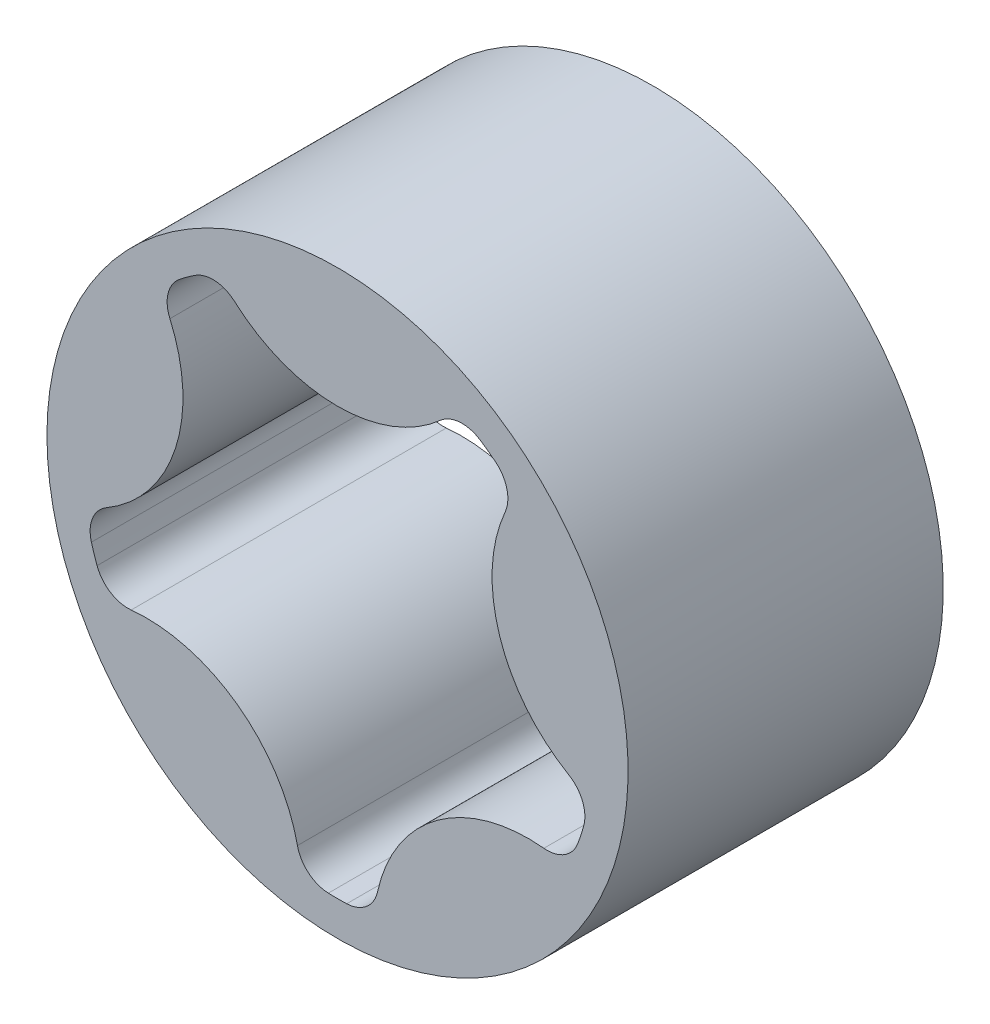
from build123d import *

# Parameters (mm, degrees)
SKETCH1_R          = 20.2565
BASE_EXTRUDE_DEPTH = 21.971


with BuildPart() as part:
    # Sketch1 → Base-Extrude (new body)
    with BuildSketch(Plane.XY):
        with Locations(Location((0, 0, 0), (0, 0, 180))):
            Circle(SKETCH1_R)
        with BuildLine():
            ThreePointArc((-9.962871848, 14.803096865), (-10.488146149, 14.435694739), (-10.999885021, 14.049662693))
            ThreePointArc((-10.999885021, 14.049662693), (-11.807615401, 12.807242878), (-11.683709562, 11.330529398))
            ThreePointArc((-11.683709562, 11.330529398), (-11.301861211, 3.672197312), (-16.112237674, -2.299078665))
            ThreePointArc((-16.112237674, -2.299078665), (-17.080470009, -3.420934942), (-17.157278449, -4.900845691))
            ThreePointArc((-17.157278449, -4.900845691), (-16.970176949, -5.513944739), (-16.761174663, -6.11992779))
            ThreePointArc((-16.761174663, -6.11992779), (-15.829165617, -7.272053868), (-14.386438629, -7.610541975))
            ThreePointArc((-14.386438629, -7.610541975), (-6.984934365, -9.613937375), (-2.792401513, -16.034103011))
            ThreePointArc((-2.792401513, -16.034103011), (-2.024653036, -17.301619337), (-0.640909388, -17.831986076))
            ThreePointArc((-0.640909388, -17.831986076), (0, -17.8435), (0.640909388, -17.831986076))
            ThreePointArc((0.640909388, -17.831986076), (2.024653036, -17.301619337), (2.792401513, -16.034103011))
            ThreePointArc((2.792401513, -16.034103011), (6.984934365, -9.613937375), (14.386438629, -7.610541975))
            ThreePointArc((14.386438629, -7.610541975), (15.829165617, -7.272053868), (16.761174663, -6.11992779))
            ThreePointArc((16.761174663, -6.11992779), (16.970176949, -5.513944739), (17.157278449, -4.900845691))
            ThreePointArc((17.157278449, -4.900845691), (17.080470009, -3.420934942), (16.112237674, -2.299078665))
            ThreePointArc((16.112237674, -2.299078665), (11.301861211, 3.672197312), (11.683709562, 11.330529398))
            ThreePointArc((11.683709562, 11.330529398), (11.807615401, 12.807242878), (10.999885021, 14.049662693))
            ThreePointArc((10.999885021, 14.049662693), (10.488146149, 14.435694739), (9.962871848, 14.803096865))
            ThreePointArc((9.962871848, 14.803096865), (8.531657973, 15.187365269), (7.165509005, 14.613194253))
            ThreePointArc((7.165509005, 14.613194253), (0, 11.883480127), (-7.165509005, 14.613194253))
            ThreePointArc((-7.165509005, 14.613194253), (-8.531657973, 15.187365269), (-9.962871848, 14.803096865))
        make_face(mode=Mode.SUBTRACT)
    extrude(amount=BASE_EXTRUDE_DEPTH)


solid = part.part
